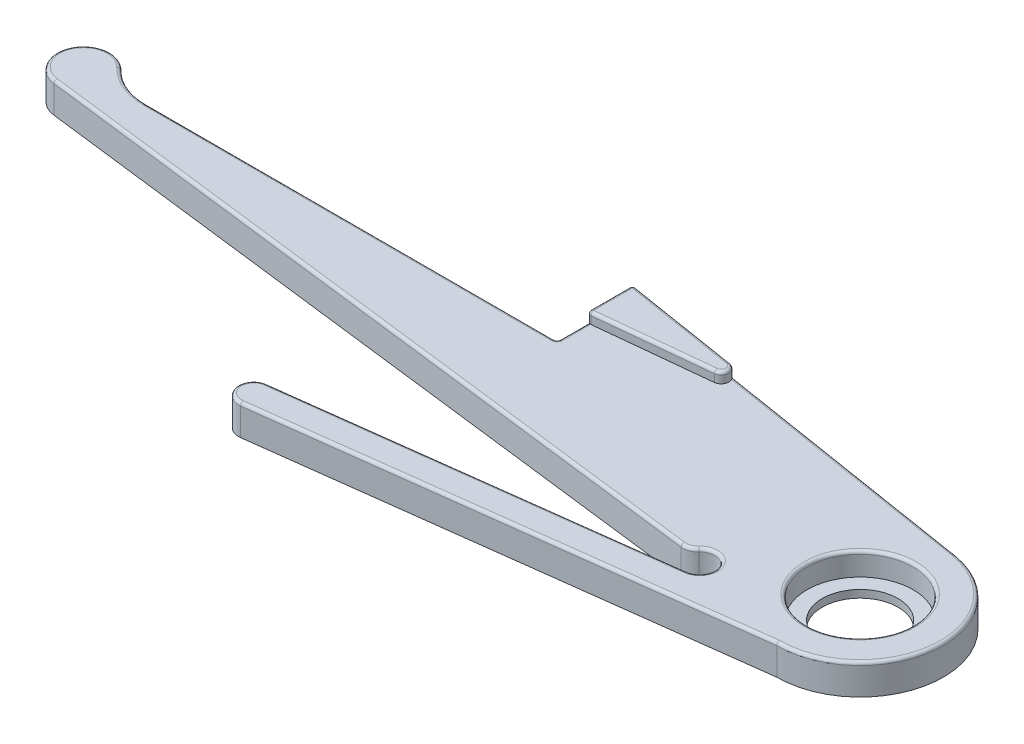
from build123d import *

# Parameters (mm, degrees)
BOSS_EXTRUDE1_DEPTH             = 2
BOSS_EXTRUDE2_DEPTH             = 0.7000000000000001
M7X1_0_TAPPED_HOLE1_D           = 5
M7X1_0_TAPPED_HOLE1_CBORE_D     = 7
M7X1_0_TAPPED_HOLE1_CBORE_DEPTH = 1.5
FILLET1_R                       = 4
FILLET2_R                       = 0.20000000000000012


with BuildPart() as part:
    # Sketch1 → Boss-Extrude1 (new body)
    with BuildSketch(Plane(origin=(0, 2, 0), x_dir=(1, 0, 0), z_dir=(0, 1, 0))):
        with BuildLine():
            Line((0.8710441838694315, 5.430587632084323), (-24.5, 9.499999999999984))
            Line((-24.5, 9.499999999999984), (-24.500000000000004, 4.499999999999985))
            Line((-24.500000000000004, 4.499999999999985), (-54.000005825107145, 4.499999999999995))
            ThreePointArc((-54.000005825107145, 4.499999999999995), (-56.90789324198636, 5.816682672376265), (-55.963271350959, 2.7675595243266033))
            Line((-55.963271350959, 2.7675595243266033), (-8.782371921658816, -3.0255264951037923))
            ThreePointArc((-8.782371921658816, -3.0255264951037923), (-8.317101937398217, -2.972169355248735), (-7.927147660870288, -2.7128263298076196))
            ThreePointArc((-7.927147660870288, -2.7128263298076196), (-6.3045053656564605, -2.9353234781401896), (-7.067352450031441, -4.384646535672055))
            Line((-7.067352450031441, -4.384646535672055), (-31.634466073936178, -7.516051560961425))
            ThreePointArc((-31.634466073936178, -7.516051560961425), (-32.50000000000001, -8.634466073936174), (-31.38158548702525, -9.5))
            Line((-31.38158548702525, -9.5), (6.7e-16, -5.5))
            ThreePointArc((6.7e-16, -5.5), (5.482619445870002, -0.4369027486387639), (0.8710441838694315, 5.430587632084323))
        make_face()
    extrude(amount=-BOSS_EXTRUDE1_DEPTH)

    # Sketch2 → Boss-Extrude2 (add)
    with BuildSketch(Plane(origin=(0, 2, 0), x_dir=(-1, 0, 0), z_dir=(0, 1, 0))):
        with BuildLine():
            Line((16.893389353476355, -7.284403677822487), (24.500000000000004, -6.499999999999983))
            Line((24.500000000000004, -6.499999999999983), (24.5, -9.499999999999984))
            Line((24.5, -9.499999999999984), (16.86549219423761, -8.275455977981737))
            ThreePointArc((16.86549219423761, -8.275455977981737), (16.444876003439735, -7.767697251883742), (16.893389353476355, -7.284403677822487))
        make_face()
    extrude(amount=BOSS_EXTRUDE2_DEPTH)

    # M7x1.0 Tapped Hole1 (through all)
    with Locations(Plane(origin=(0, 2, 0), x_dir=(1, 0, 0), z_dir=(0, 1, 0))):
        with Locations((0, 0)):
            CounterBoreHole(M7X1_0_TAPPED_HOLE1_D / 2, M7X1_0_TAPPED_HOLE1_CBORE_D / 2, M7X1_0_TAPPED_HOLE1_CBORE_DEPTH)

    # Fillet1
    fillet1_edges = [part.edges().sort_by_distance(p)[0] for p in [
        (-54.000005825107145, 1, -4.499999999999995),
    ]]
    fillet(fillet1_edges, radius=FILLET1_R)

    # Fillet2
    fillet2_edges = [part.edges().sort_by_distance(p)[0] for p in [
        (-15.690792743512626, 2, 7.5),
        (-32.50000000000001, 2, 8.634466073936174),
        (-19.35090926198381, 2, 5.95034904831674),
        (-6.3045053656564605, 2, 2.93532347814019),
        (-8.317101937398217, 2, 2.9721693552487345),
        (-32.372821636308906, 2, 0.1289834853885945),
        (-38.057477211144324, 2, -4.499999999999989),
        (-7.997224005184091, 2, -6.8530218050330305),
        (5.48261944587, 2, 0.4369027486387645),
        (-24.500000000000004, 1, -4.499999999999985),
        (-24.5, 1.35, -9.499999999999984),
        (-24.500000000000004, 2, -5.499999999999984),
        (-24.500000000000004, 2.35, -6.499999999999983),
        (-16.444876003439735, 2.7, -7.767697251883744),
        (-20.682746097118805, 2.7, -8.88772798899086),
        (-24.5, 2.7, -7.999999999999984),
        (-20.69669467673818, 2.7, -6.892201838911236),
        (-3.5, 2, -4.3e-16),
        (-57.31624831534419, 2, -5.285134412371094),
        (-53.177345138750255, 2, -4.817754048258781),
    ]]
    fillet(fillet2_edges, radius=FILLET2_R)


solid = part.part
